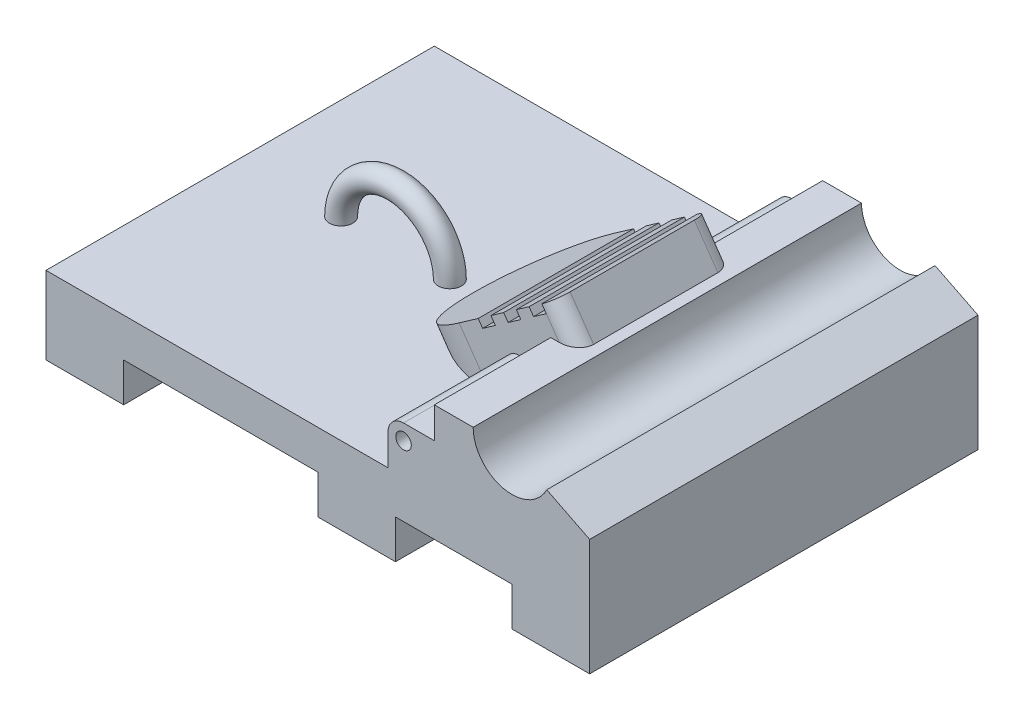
ISO-10303-21;
HEADER;
FILE_DESCRIPTION(('STEP AP214'),'2;1');
FILE_NAME('part.step','',(''),(''),'','','');
FILE_SCHEMA(('AUTOMOTIVE_DESIGN { 1 0 10303 214 1 1 1 1 }'));
ENDSEC;
DATA;
#1=APPLICATION_CONTEXT('core data for automotive mechanical design processes');
#2=APPLICATION_PROTOCOL_DEFINITION('international standard','automotive_design',2000,#1);
#3=PRODUCT_CONTEXT('',#1,'mechanical');
#4=PRODUCT('Part','Part','',(#3));
#5=PRODUCT_RELATED_PRODUCT_CATEGORY('part','',(#4));
#6=PRODUCT_DEFINITION_FORMATION('','',#4);
#7=PRODUCT_DEFINITION_CONTEXT('part definition',#1,'design');
#8=PRODUCT_DEFINITION('design','',#6,#7);
#9=PRODUCT_DEFINITION_SHAPE('','',#8);
#10=(LENGTH_UNIT() NAMED_UNIT(*) SI_UNIT(.MILLI.,.METRE.));
#11=(NAMED_UNIT(*) PLANE_ANGLE_UNIT() SI_UNIT($,.RADIAN.));
#12=(NAMED_UNIT(*) SI_UNIT($,.STERADIAN.) SOLID_ANGLE_UNIT());
#13=UNCERTAINTY_MEASURE_WITH_UNIT(LENGTH_MEASURE(1.E-05),#10,'distance_accuracy_value','');
#14=(GEOMETRIC_REPRESENTATION_CONTEXT(3) GLOBAL_UNCERTAINTY_ASSIGNED_CONTEXT((#13)) GLOBAL_UNIT_ASSIGNED_CONTEXT((#10,
#11,#12)) REPRESENTATION_CONTEXT('',''));
#15=CARTESIAN_POINT('',(0.,0.,0.));
#16=DIRECTION('',(0.,0.,1.));
#17=DIRECTION('',(1.,0.,0.));
#18=AXIS2_PLACEMENT_3D('',#15,#16,#17);
#19=CARTESIAN_POINT('',(76.2,38.1,63.5));
#20=DIRECTION('',(-0.447213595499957,-0.894427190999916,0.));
#21=DIRECTION('',(0.894427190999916,-0.447213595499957,0.));
#22=AXIS2_PLACEMENT_3D('',#19,#20,#21);
#23=PLANE('',#22);
#24=DIRECTION('',(0.,0.,-1.));
#25=VECTOR('',#24,1.);
#26=CARTESIAN_POINT('',(62.1592253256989,45.1203873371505,458.470833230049));
#27=LINE('',#26,#25);
#28=CARTESIAN_POINT('',(62.1592253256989,45.1203873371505,63.5000000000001));
#29=VERTEX_POINT('',#28);
#30=CARTESIAN_POINT('',(62.1592253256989,45.1203873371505,-63.5));
#31=VERTEX_POINT('',#30);
#32=EDGE_CURVE('E67',#29,#31,#27,.T.);
#33=ORIENTED_EDGE('',*,*,#32,.F.);
#34=DIRECTION('',(-0.894427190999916,0.447213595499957,0.));
#35=VECTOR('',#34,1.);
#36=CARTESIAN_POINT('',(76.2,38.1,63.5));
#37=LINE('',#36,#35);
#38=CARTESIAN_POINT('',(76.2,38.1,63.5));
#39=VERTEX_POINT('',#38);
#40=EDGE_CURVE('E332',#39,#29,#37,.T.);
#41=ORIENTED_EDGE('',*,*,#40,.F.);
#42=DIRECTION('',(0.,0.,-1.));
#43=VECTOR('',#42,1.);
#44=CARTESIAN_POINT('',(76.2,38.1,63.5));
#45=LINE('',#44,#43);
#46=CARTESIAN_POINT('',(76.2,38.1,-63.5));
#47=VERTEX_POINT('',#46);
#48=EDGE_CURVE('E437',#39,#47,#45,.T.);
#49=ORIENTED_EDGE('',*,*,#48,.T.);
#50=DIRECTION('',(-0.894427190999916,0.447213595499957,0.));
#51=VECTOR('',#50,1.);
#52=CARTESIAN_POINT('',(76.2,38.1,-63.5));
#53=LINE('',#52,#51);
#54=EDGE_CURVE('E389',#47,#31,#53,.T.);
#55=ORIENTED_EDGE('',*,*,#54,.T.);
#56=EDGE_LOOP('',(#33,#41,#49,#55));
#57=FACE_BOUND('',#56,.T.);
#58=ADVANCED_FACE('F51',(#57),#23,.F.);
#59=CARTESIAN_POINT('',(-4.59353807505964,39.9688414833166,0.));
#60=DIRECTION('',(-0.573576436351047,0.819152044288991,0.));
#61=DIRECTION('',(-0.819152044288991,-0.573576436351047,0.));
#62=AXIS2_PLACEMENT_3D('',#59,#60,#61);
#63=PLANE('',#62);
#64=DIRECTION('',(0.,0.,1.));
#65=VECTOR('',#64,1.);
#66=CARTESIAN_POINT('',(18.2935700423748,55.9945671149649,-25.4));
#67=LINE('',#66,#65);
#68=CARTESIAN_POINT('',(18.2935700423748,55.9945671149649,-25.4));
#69=VERTEX_POINT('',#68);
#70=CARTESIAN_POINT('',(18.2935700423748,55.9945671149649,25.4));
#71=VERTEX_POINT('',#70);
#72=EDGE_CURVE('E588',#69,#71,#67,.T.);
#73=ORIENTED_EDGE('',*,*,#72,.F.);
#74=DIRECTION('',(-0.819152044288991,-0.573576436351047,0.));
#75=VECTOR('',#74,1.);
#76=CARTESIAN_POINT('',(-4.59353807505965,39.9688414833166,-25.4));
#77=LINE('',#76,#75);
#78=CARTESIAN_POINT('',(14.1322776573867,53.0807988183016,-25.3999999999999));
#79=VERTEX_POINT('',#78);
#80=EDGE_CURVE('E680',#69,#79,#77,.T.);
#81=ORIENTED_EDGE('',*,*,#80,.T.);
#82=DIRECTION('',(0.,0.,-1.));
#83=VECTOR('',#82,1.);
#84=CARTESIAN_POINT('',(14.1322776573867,53.0807988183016,-25.3999999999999));
#85=LINE('',#84,#83);
#86=CARTESIAN_POINT('',(14.1322776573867,53.0807988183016,25.4000000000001));
#87=VERTEX_POINT('',#86);
#88=EDGE_CURVE('E620',#87,#79,#85,.T.);
#89=ORIENTED_EDGE('',*,*,#88,.F.);
#90=DIRECTION('',(0.819152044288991,0.573576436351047,0.));
#91=VECTOR('',#90,1.);
#92=CARTESIAN_POINT('',(26.6161548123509,61.8221037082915,25.4));
#93=LINE('',#92,#91);
#94=EDGE_CURVE('E674',#87,#71,#93,.T.);
#95=ORIENTED_EDGE('',*,*,#94,.T.);
#96=EDGE_LOOP('',(#73,#81,#89,#95));
#97=FACE_BOUND('',#96,.T.);
#98=ADVANCED_FACE('F911',(#97),#63,.T.);
#99=DIRECTION('',(0.,0.,-1.));
#100=VECTOR('',#99,1.);
#101=CARTESIAN_POINT('',(22.4548624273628,58.9083354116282,-25.4));
#102=LINE('',#101,#100);
#103=CARTESIAN_POINT('',(22.4548624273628,58.9083354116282,25.4));
#104=VERTEX_POINT('',#103);
#105=CARTESIAN_POINT('',(22.4548624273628,58.9083354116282,-25.4));
#106=VERTEX_POINT('',#105);
#107=EDGE_CURVE('E576',#104,#106,#102,.T.);
#108=ORIENTED_EDGE('',*,*,#107,.F.);
#109=CARTESIAN_POINT('',(22.4548624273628,58.9083354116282,20.32));
#110=DIRECTION('',(-0.573576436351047,0.819152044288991,0.));
#111=DIRECTION('',(-0.819152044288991,-0.573576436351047,0.));
#112=AXIS2_PLACEMENT_3D('',#109,#110,#111);
#113=CIRCLE('',#112,5.08);
#114=CARTESIAN_POINT('',(26.6161548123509,61.8221037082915,20.32));
#115=VERTEX_POINT('',#114);
#116=EDGE_CURVE('E472',#104,#115,#113,.T.);
#117=ORIENTED_EDGE('',*,*,#116,.T.);
#118=DIRECTION('',(0.,0.,-1.));
#119=VECTOR('',#118,1.);
#120=CARTESIAN_POINT('',(26.6161548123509,61.8221037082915,-25.4));
#121=LINE('',#120,#119);
#122=CARTESIAN_POINT('',(26.6161548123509,61.8221037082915,-20.32));
#123=VERTEX_POINT('',#122);
#124=EDGE_CURVE('E679',#115,#123,#121,.T.);
#125=ORIENTED_EDGE('',*,*,#124,.T.);
#126=CARTESIAN_POINT('',(22.4548624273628,58.9083354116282,-20.32));
#127=DIRECTION('',(-0.573576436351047,0.819152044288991,0.));
#128=DIRECTION('',(-0.819152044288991,-0.573576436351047,0.));
#129=AXIS2_PLACEMENT_3D('',#126,#127,#128);
#130=CIRCLE('',#129,5.08);
#131=EDGE_CURVE('E475',#123,#106,#130,.T.);
#132=ORIENTED_EDGE('',*,*,#131,.T.);
#133=EDGE_LOOP('',(#108,#117,#125,#132));
#134=FACE_BOUND('',#133,.T.);
#135=ADVANCED_FACE('F873',(#134),#63,.T.);
#136=DIRECTION('',(0.,0.,1.));
#137=VECTOR('',#136,1.);
#138=CARTESIAN_POINT('',(9.97098527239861,50.1670305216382,-25.3999999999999));
#139=LINE('',#138,#137);
#140=CARTESIAN_POINT('',(9.97098527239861,50.1670305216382,-25.3999999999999));
#141=VERTEX_POINT('',#140);
#142=CARTESIAN_POINT('',(9.97098527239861,50.1670305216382,25.4000000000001));
#143=VERTEX_POINT('',#142);
#144=EDGE_CURVE('E591',#141,#143,#139,.T.);
#145=ORIENTED_EDGE('',*,*,#144,.F.);
#146=CARTESIAN_POINT('',(5.80969288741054,47.2532622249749,-25.3999999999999));
#147=VERTEX_POINT('',#146);
#148=EDGE_CURVE('E678',#141,#147,#77,.T.);
#149=ORIENTED_EDGE('',*,*,#148,.T.);
#150=DIRECTION('',(0.,0.,-1.));
#151=VECTOR('',#150,1.);
#152=CARTESIAN_POINT('',(5.80969288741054,47.2532622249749,-25.3999999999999));
#153=LINE('',#152,#151);
#154=CARTESIAN_POINT('',(5.80969288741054,47.2532622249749,25.4000000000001));
#155=VERTEX_POINT('',#154);
#156=EDGE_CURVE('E652',#155,#147,#153,.T.);
#157=ORIENTED_EDGE('',*,*,#156,.F.);
#158=EDGE_CURVE('E685',#155,#143,#93,.T.);
#159=ORIENTED_EDGE('',*,*,#158,.T.);
#160=EDGE_LOOP('',(#145,#149,#157,#159));
#161=FACE_BOUND('',#160,.T.);
#162=ADVANCED_FACE('F934',(#161),#63,.T.);
#163=CARTESIAN_POINT('',(25.4,50.8,63.5));
#164=DIRECTION('',(1.,0.,0.));
#165=DIRECTION('',(0.,1.,0.));
#166=AXIS2_PLACEMENT_3D('',#163,#164,#165);
#167=PLANE('',#166);
#168=DIRECTION('',(0.,1.,0.));
#169=VECTOR('',#168,1.);
#170=CARTESIAN_POINT('',(25.4,-2.95957555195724,25.4));
#171=LINE('',#170,#169);
#172=CARTESIAN_POINT('',(25.4,40.64,25.4));
#173=VERTEX_POINT('',#172);
#174=CARTESIAN_POINT('',(25.4,50.8,25.4));
#175=VERTEX_POINT('',#174);
#176=EDGE_CURVE('E712',#173,#175,#171,.T.);
#177=ORIENTED_EDGE('',*,*,#176,.F.);
#178=DIRECTION('',(0.,0.,1.));
#179=VECTOR('',#178,1.);
#180=CARTESIAN_POINT('',(25.4,40.64,-84.9921967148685));
#181=LINE('',#180,#179);
#182=CARTESIAN_POINT('',(25.4,40.64,63.5));
#183=VERTEX_POINT('',#182);
#184=EDGE_CURVE('E545',#173,#183,#181,.T.);
#185=ORIENTED_EDGE('',*,*,#184,.T.);
#186=DIRECTION('',(0.,-1.,0.));
#187=VECTOR('',#186,1.);
#188=CARTESIAN_POINT('',(25.4,50.8,63.5));
#189=LINE('',#188,#187);
#190=CARTESIAN_POINT('',(25.4,50.8,63.5));
#191=VERTEX_POINT('',#190);
#192=EDGE_CURVE('E342',#191,#183,#189,.T.);
#193=ORIENTED_EDGE('',*,*,#192,.F.);
#194=DIRECTION('',(0.,0.,-1.));
#195=VECTOR('',#194,1.);
#196=CARTESIAN_POINT('',(25.4,50.8,63.5));
#197=LINE('',#196,#195);
#198=EDGE_CURVE('E339',#191,#175,#197,.T.);
#199=ORIENTED_EDGE('',*,*,#198,.T.);
#200=EDGE_LOOP('',(#177,#185,#193,#199));
#201=FACE_BOUND('',#200,.T.);
#202=ADVANCED_FACE('F779',(#201),#167,.F.);
#203=CARTESIAN_POINT('',(-12.7,12.7,63.5));
#204=DIRECTION('',(1.,0.,0.));
#205=DIRECTION('',(0.,1.,0.));
#206=AXIS2_PLACEMENT_3D('',#203,#204,#205);
#207=PLANE('',#206);
#208=DIRECTION('',(0.,-1.,0.));
#209=VECTOR('',#208,1.);
#210=CARTESIAN_POINT('',(-12.7,12.7,-63.5));
#211=LINE('',#210,#209);
#212=CARTESIAN_POINT('',(-12.7,12.7,-63.5));
#213=VERTEX_POINT('',#212);
#214=CARTESIAN_POINT('',(-12.7,0.,-63.5));
#215=VERTEX_POINT('',#214);
#216=EDGE_CURVE('E366',#213,#215,#211,.T.);
#217=ORIENTED_EDGE('',*,*,#216,.T.);
#218=DIRECTION('',(0.,0.,-1.));
#219=VECTOR('',#218,1.);
#220=CARTESIAN_POINT('',(-12.7,0.,63.5));
#221=LINE('',#220,#219);
#222=CARTESIAN_POINT('',(-12.7,0.,63.5));
#223=VERTEX_POINT('',#222);
#224=EDGE_CURVE('E461',#223,#215,#221,.T.);
#225=ORIENTED_EDGE('',*,*,#224,.F.);
#226=DIRECTION('',(0.,-1.,0.));
#227=VECTOR('',#226,1.);
#228=CARTESIAN_POINT('',(-12.7,12.7,63.5));
#229=LINE('',#228,#227);
#230=CARTESIAN_POINT('',(-12.7,12.7,63.5));
#231=VERTEX_POINT('',#230);
#232=EDGE_CURVE('E414',#231,#223,#229,.T.);
#233=ORIENTED_EDGE('',*,*,#232,.F.);
#234=DIRECTION('',(0.,0.,-1.));
#235=VECTOR('',#234,1.);
#236=CARTESIAN_POINT('',(-12.7,12.7,63.5));
#237=LINE('',#236,#235);
#238=EDGE_CURVE('E365',#231,#213,#237,.T.);
#239=ORIENTED_EDGE('',*,*,#238,.T.);
#240=EDGE_LOOP('',(#217,#225,#233,#239));
#241=FACE_BOUND('',#240,.T.);
#242=ADVANCED_FACE('F828',(#241),#207,.F.);
#243=CARTESIAN_POINT('',(12.7,0.,63.5));
#244=DIRECTION('',(0.,1.,0.));
#245=DIRECTION('',(-1.,0.,0.));
#246=AXIS2_PLACEMENT_3D('',#243,#244,#245);
#247=PLANE('',#246);
#248=DIRECTION('',(1.,0.,0.));
#249=VECTOR('',#248,1.);
#250=CARTESIAN_POINT('',(12.7,0.,-63.5));
#251=LINE('',#250,#249);
#252=CARTESIAN_POINT('',(12.7,0.,-63.5));
#253=VERTEX_POINT('',#252);
#254=EDGE_CURVE('E370',#215,#253,#251,.T.);
#255=ORIENTED_EDGE('',*,*,#254,.T.);
#256=DIRECTION('',(0.,0.,-1.));
#257=VECTOR('',#256,1.);
#258=CARTESIAN_POINT('',(12.7,0.,63.5));
#259=LINE('',#258,#257);
#260=CARTESIAN_POINT('',(12.7,0.,63.5));
#261=VERTEX_POINT('',#260);
#262=EDGE_CURVE('E457',#261,#253,#259,.T.);
#263=ORIENTED_EDGE('',*,*,#262,.F.);
#264=DIRECTION('',(1.,0.,0.));
#265=VECTOR('',#264,1.);
#266=CARTESIAN_POINT('',(12.7,0.,63.5));
#267=LINE('',#266,#265);
#268=EDGE_CURVE('E725',#223,#261,#267,.T.);
#269=ORIENTED_EDGE('',*,*,#268,.F.);
#270=ORIENTED_EDGE('',*,*,#224,.T.);
#271=EDGE_LOOP('',(#255,#263,#269,#270));
#272=FACE_BOUND('',#271,.T.);
#273=ADVANCED_FACE('F833',(#272),#247,.F.);
#274=CARTESIAN_POINT('',(12.7,0.,63.5));
#275=DIRECTION('',(-1.,0.,0.));
#276=DIRECTION('',(0.,-1.,0.));
#277=AXIS2_PLACEMENT_3D('',#274,#275,#276);
#278=PLANE('',#277);
#279=DIRECTION('',(0.,1.,0.));
#280=VECTOR('',#279,1.);
#281=CARTESIAN_POINT('',(12.7,0.,-63.5));
#282=LINE('',#281,#280);
#283=CARTESIAN_POINT('',(12.7,12.7,-63.5));
#284=VERTEX_POINT('',#283);
#285=EDGE_CURVE('E374',#253,#284,#282,.T.);
#286=ORIENTED_EDGE('',*,*,#285,.T.);
#287=DIRECTION('',(0.,0.,-1.));
#288=VECTOR('',#287,1.);
#289=CARTESIAN_POINT('',(12.7,12.7,63.5));
#290=LINE('',#289,#288);
#291=CARTESIAN_POINT('',(12.7,12.7,63.5));
#292=VERTEX_POINT('',#291);
#293=EDGE_CURVE('E453',#292,#284,#290,.T.);
#294=ORIENTED_EDGE('',*,*,#293,.F.);
#295=DIRECTION('',(0.,1.,0.));
#296=VECTOR('',#295,1.);
#297=CARTESIAN_POINT('',(12.7,0.,63.5));
#298=LINE('',#297,#296);
#299=EDGE_CURVE('E728',#261,#292,#298,.T.);
#300=ORIENTED_EDGE('',*,*,#299,.F.);
#301=ORIENTED_EDGE('',*,*,#262,.T.);
#302=EDGE_LOOP('',(#286,#294,#300,#301));
#303=FACE_BOUND('',#302,.T.);
#304=ADVANCED_FACE('F836',(#303),#278,.F.);
#305=CARTESIAN_POINT('',(12.7,12.7,63.5));
#306=DIRECTION('',(0.,1.,0.));
#307=DIRECTION('',(0.,0.,1.));
#308=AXIS2_PLACEMENT_3D('',#305,#306,#307);
#309=PLANE('',#308);
#310=DIRECTION('',(1.,0.,0.));
#311=VECTOR('',#310,1.);
#312=CARTESIAN_POINT('',(12.7,12.7,-63.5));
#313=LINE('',#312,#311);
#314=CARTESIAN_POINT('',(50.8,12.7,-63.5));
#315=VERTEX_POINT('',#314);
#316=EDGE_CURVE('E377',#284,#315,#313,.T.);
#317=ORIENTED_EDGE('',*,*,#316,.T.);
#318=DIRECTION('',(0.,0.,-1.));
#319=VECTOR('',#318,1.);
#320=CARTESIAN_POINT('',(50.8,12.7,63.5));
#321=LINE('',#320,#319);
#322=CARTESIAN_POINT('',(50.8,12.7,63.5));
#323=VERTEX_POINT('',#322);
#324=EDGE_CURVE('E449',#323,#315,#321,.T.);
#325=ORIENTED_EDGE('',*,*,#324,.F.);
#326=DIRECTION('',(1.,0.,0.));
#327=VECTOR('',#326,1.);
#328=CARTESIAN_POINT('',(12.7,12.7,63.5));
#329=LINE('',#328,#327);
#330=EDGE_CURVE('E731',#292,#323,#329,.T.);
#331=ORIENTED_EDGE('',*,*,#330,.F.);
#332=ORIENTED_EDGE('',*,*,#293,.T.);
#333=EDGE_LOOP('',(#317,#325,#331,#332));
#334=FACE_BOUND('',#333,.T.);
#335=ADVANCED_FACE('F841',(#334),#309,.F.);
#336=CARTESIAN_POINT('',(50.8,12.7,63.5));
#337=DIRECTION('',(1.,0.,0.));
#338=DIRECTION('',(0.,0.,-1.));
#339=AXIS2_PLACEMENT_3D('',#336,#337,#338);
#340=PLANE('',#339);
#341=DIRECTION('',(0.,-1.,0.));
#342=VECTOR('',#341,1.);
#343=CARTESIAN_POINT('',(50.8,12.7,-63.5));
#344=LINE('',#343,#342);
#345=CARTESIAN_POINT('',(50.8,0.,-63.5));
#346=VERTEX_POINT('',#345);
#347=EDGE_CURVE('E380',#315,#346,#344,.T.);
#348=ORIENTED_EDGE('',*,*,#347,.T.);
#349=DIRECTION('',(0.,0.,-1.));
#350=VECTOR('',#349,1.);
#351=CARTESIAN_POINT('',(50.8,0.,63.5));
#352=LINE('',#351,#350);
#353=CARTESIAN_POINT('',(50.8,0.,63.5));
#354=VERTEX_POINT('',#353);
#355=EDGE_CURVE('E445',#354,#346,#352,.T.);
#356=ORIENTED_EDGE('',*,*,#355,.F.);
#357=DIRECTION('',(0.,-1.,0.));
#358=VECTOR('',#357,1.);
#359=CARTESIAN_POINT('',(50.8,12.7,63.5));
#360=LINE('',#359,#358);
#361=EDGE_CURVE('E734',#323,#354,#360,.T.);
#362=ORIENTED_EDGE('',*,*,#361,.F.);
#363=ORIENTED_EDGE('',*,*,#324,.T.);
#364=EDGE_LOOP('',(#348,#356,#362,#363));
#365=FACE_BOUND('',#364,.T.);
#366=ADVANCED_FACE('F845',(#365),#340,.F.);
#367=CARTESIAN_POINT('',(50.8,0.,63.5));
#368=DIRECTION('',(0.,1.,0.));
#369=DIRECTION('',(-1.,0.,0.));
#370=AXIS2_PLACEMENT_3D('',#367,#368,#369);
#371=PLANE('',#370);
#372=DIRECTION('',(1.,0.,0.));
#373=VECTOR('',#372,1.);
#374=CARTESIAN_POINT('',(50.8,0.,-63.5));
#375=LINE('',#374,#373);
#376=CARTESIAN_POINT('',(76.2,0.,-63.5));
#377=VERTEX_POINT('',#376);
#378=EDGE_CURVE('E383',#346,#377,#375,.T.);
#379=ORIENTED_EDGE('',*,*,#378,.T.);
#380=DIRECTION('',(0.,0.,-1.));
#381=VECTOR('',#380,1.);
#382=CARTESIAN_POINT('',(76.2,0.,63.5));
#383=LINE('',#382,#381);
#384=CARTESIAN_POINT('',(76.2,0.,63.5));
#385=VERTEX_POINT('',#384);
#386=EDGE_CURVE('E441',#385,#377,#383,.T.);
#387=ORIENTED_EDGE('',*,*,#386,.F.);
#388=DIRECTION('',(1.,0.,0.));
#389=VECTOR('',#388,1.);
#390=CARTESIAN_POINT('',(50.8,0.,63.5));
#391=LINE('',#390,#389);
#392=EDGE_CURVE('E737',#354,#385,#391,.T.);
#393=ORIENTED_EDGE('',*,*,#392,.F.);
#394=ORIENTED_EDGE('',*,*,#355,.T.);
#395=EDGE_LOOP('',(#379,#387,#393,#394));
#396=FACE_BOUND('',#395,.T.);
#397=ADVANCED_FACE('F849',(#396),#371,.F.);
#398=CARTESIAN_POINT('',(76.2,0.,63.5));
#399=DIRECTION('',(-1.,0.,0.));
#400=DIRECTION('',(0.,-1.,0.));
#401=AXIS2_PLACEMENT_3D('',#398,#399,#400);
#402=PLANE('',#401);
#403=DIRECTION('',(0.,1.,0.));
#404=VECTOR('',#403,1.);
#405=CARTESIAN_POINT('',(76.2,0.,-63.5));
#406=LINE('',#405,#404);
#407=EDGE_CURVE('E386',#377,#47,#406,.T.);
#408=ORIENTED_EDGE('',*,*,#407,.T.);
#409=ORIENTED_EDGE('',*,*,#48,.F.);
#410=DIRECTION('',(0.,1.,0.));
#411=VECTOR('',#410,1.);
#412=CARTESIAN_POINT('',(76.2,0.,63.5));
#413=LINE('',#412,#411);
#414=EDGE_CURVE('E347',#385,#39,#413,.T.);
#415=ORIENTED_EDGE('',*,*,#414,.F.);
#416=ORIENTED_EDGE('',*,*,#386,.T.);
#417=EDGE_LOOP('',(#408,#409,#415,#416));
#418=FACE_BOUND('',#417,.T.);
#419=ADVANCED_FACE('F745',(#418),#402,.F.);
#420=CARTESIAN_POINT('',(50.8,50.8,63.5));
#421=DIRECTION('',(0.,-1.,0.));
#422=DIRECTION('',(1.,0.,0.));
#423=AXIS2_PLACEMENT_3D('',#420,#421,#422);
#424=PLANE('',#423);
#425=DIRECTION('',(-1.,0.,0.));
#426=VECTOR('',#425,1.);
#427=CARTESIAN_POINT('',(50.8,50.8,63.5));
#428=LINE('',#427,#426);
#429=CARTESIAN_POINT('',(38.1,50.8,63.5000000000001));
#430=VERTEX_POINT('',#429);
#431=EDGE_CURVE('E329',#430,#191,#428,.T.);
#432=ORIENTED_EDGE('',*,*,#431,.F.);
#433=DIRECTION('',(0.,0.,-1.));
#434=VECTOR('',#433,1.);
#435=CARTESIAN_POINT('',(38.1,50.8,458.470833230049));
#436=LINE('',#435,#434);
#437=CARTESIAN_POINT('',(38.1,50.8,-63.4999999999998));
#438=VERTEX_POINT('',#437);
#439=EDGE_CURVE('E315',#430,#438,#436,.T.);
#440=ORIENTED_EDGE('',*,*,#439,.T.);
#441=DIRECTION('',(-1.,0.,0.));
#442=VECTOR('',#441,1.);
#443=CARTESIAN_POINT('',(50.8,50.8,-63.5));
#444=LINE('',#443,#442);
#445=CARTESIAN_POINT('',(25.4,50.8,-63.5));
#446=VERTEX_POINT('',#445);
#447=EDGE_CURVE('E393',#438,#446,#444,.T.);
#448=ORIENTED_EDGE('',*,*,#447,.T.);
#449=CARTESIAN_POINT('',(25.4,50.8,-25.4));
#450=VERTEX_POINT('',#449);
#451=EDGE_CURVE('E434',#450,#446,#197,.T.);
#452=ORIENTED_EDGE('',*,*,#451,.F.);
#453=DIRECTION('',(-1.,0.,0.));
#454=VECTOR('',#453,1.);
#455=CARTESIAN_POINT('',(40.7670820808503,50.8,-25.4));
#456=LINE('',#455,#454);
#457=CARTESIAN_POINT('',(28.1323800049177,50.8,-25.4));
#458=VERTEX_POINT('',#457);
#459=EDGE_CURVE('E692',#458,#450,#456,.T.);
#460=ORIENTED_EDGE('',*,*,#459,.F.);
#461=CARTESIAN_POINT('',(28.1323800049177,50.8,-20.32));
#462=DIRECTION('',(0.,-1.,0.));
#463=DIRECTION('',(-1.,0.,0.));
#464=AXIS2_PLACEMENT_3D('',#461,#462,#463);
#465=ELLIPSE('',#464,6.2015349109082,5.08);
#466=CARTESIAN_POINT('',(34.3339149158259,50.8,-20.32));
#467=VERTEX_POINT('',#466);
#468=EDGE_CURVE('E487',#458,#467,#465,.T.);
#469=ORIENTED_EDGE('',*,*,#468,.T.);
#470=DIRECTION('',(0.,0.,-1.));
#471=VECTOR('',#470,1.);
#472=CARTESIAN_POINT('',(34.3339149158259,50.8,-25.4));
#473=LINE('',#472,#471);
#474=CARTESIAN_POINT('',(34.3339149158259,50.8,20.32));
#475=VERTEX_POINT('',#474);
#476=EDGE_CURVE('E704',#475,#467,#473,.T.);
#477=ORIENTED_EDGE('',*,*,#476,.F.);
#478=CARTESIAN_POINT('',(28.1323800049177,50.8,20.32));
#479=DIRECTION('',(0.,-1.,0.));
#480=DIRECTION('',(-1.,0.,0.));
#481=AXIS2_PLACEMENT_3D('',#478,#479,#480);
#482=ELLIPSE('',#481,6.2015349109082,5.08);
#483=CARTESIAN_POINT('',(28.1323800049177,50.8,25.4));
#484=VERTEX_POINT('',#483);
#485=EDGE_CURVE('E490',#475,#484,#482,.T.);
#486=ORIENTED_EDGE('',*,*,#485,.T.);
#487=DIRECTION('',(1.,0.,0.));
#488=VECTOR('',#487,1.);
#489=CARTESIAN_POINT('',(71.9767749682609,50.8,25.4));
#490=LINE('',#489,#488);
#491=EDGE_CURVE('E716',#175,#484,#490,.T.);
#492=ORIENTED_EDGE('',*,*,#491,.F.);
#493=ORIENTED_EDGE('',*,*,#198,.F.);
#494=EDGE_LOOP('',(#432,#440,#448,#452,#460,#469,#477,#486,#492,#493));
#495=FACE_BOUND('',#494,.T.);
#496=ADVANCED_FACE('F336',(#495),#424,.F.);
#497=DIRECTION('',(0.,-1.,0.));
#498=VECTOR('',#497,1.);
#499=CARTESIAN_POINT('',(25.4,50.8,-63.5));
#500=LINE('',#499,#498);
#501=CARTESIAN_POINT('',(25.4,40.64,-63.5));
#502=VERTEX_POINT('',#501);
#503=EDGE_CURVE('E396',#446,#502,#500,.T.);
#504=ORIENTED_EDGE('',*,*,#503,.T.);
#505=CARTESIAN_POINT('',(25.4,40.64,-25.4));
#506=VERTEX_POINT('',#505);
#507=EDGE_CURVE('E513',#502,#506,#181,.T.);
#508=ORIENTED_EDGE('',*,*,#507,.T.);
#509=DIRECTION('',(0.,-1.,0.));
#510=VECTOR('',#509,1.);
#511=CARTESIAN_POINT('',(25.4,-24.8128377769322,-25.4));
#512=LINE('',#511,#510);
#513=EDGE_CURVE('E520',#450,#506,#512,.T.);
#514=ORIENTED_EDGE('',*,*,#513,.F.);
#515=ORIENTED_EDGE('',*,*,#451,.T.);
#516=EDGE_LOOP('',(#504,#508,#514,#515));
#517=FACE_BOUND('',#516,.T.);
#518=ADVANCED_FACE('F855',(#517),#167,.F.);
#519=CARTESIAN_POINT('',(25.4,25.4,63.5));
#520=DIRECTION('',(0.,-1.,0.));
#521=DIRECTION('',(1.,0.,0.));
#522=AXIS2_PLACEMENT_3D('',#519,#520,#521);
#523=PLANE('',#522);
#524=CARTESIAN_POINT('',(-68.58,25.4,0.));
#525=DIRECTION('',(0.,1.,0.));
#526=DIRECTION('',(0.,0.,1.));
#527=AXIS2_PLACEMENT_3D('',#524,#525,#526);
#528=CIRCLE('',#527,3.80999999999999);
#529=CARTESIAN_POINT('',(-72.39,25.4,0.));
#530=VERTEX_POINT('',#529);
#531=EDGE_CURVE('E562',#530,#530,#528,.T.);
#532=ORIENTED_EDGE('',*,*,#531,.F.);
#533=EDGE_LOOP('',(#532));
#534=FACE_BOUND('',#533,.T.);
#535=CARTESIAN_POINT('',(-33.02,25.4,0.));
#536=DIRECTION('',(0.,-1.,0.));
#537=DIRECTION('',(0.,0.,1.));
#538=AXIS2_PLACEMENT_3D('',#535,#536,#537);
#539=CIRCLE('',#538,3.80999999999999);
#540=CARTESIAN_POINT('',(-29.21,25.4,0.));
#541=VERTEX_POINT('',#540);
#542=EDGE_CURVE('E566',#541,#541,#539,.T.);
#543=ORIENTED_EDGE('',*,*,#542,.T.);
#544=EDGE_LOOP('',(#543));
#545=FACE_BOUND('',#544,.T.);
#546=DIRECTION('',(-1.,0.,0.));
#547=VECTOR('',#546,1.);
#548=CARTESIAN_POINT('',(25.4,25.4,63.5));
#549=LINE('',#548,#547);
#550=CARTESIAN_POINT('',(10.2455643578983,25.4,63.5));
#551=VERTEX_POINT('',#550);
#552=CARTESIAN_POINT('',(-101.6,25.4,63.5));
#553=VERTEX_POINT('',#552);
#554=EDGE_CURVE('E74',#551,#553,#549,.T.);
#555=ORIENTED_EDGE('',*,*,#554,.F.);
#556=DIRECTION('',(0.,0.,1.));
#557=VECTOR('',#556,1.);
#558=CARTESIAN_POINT('',(10.2455643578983,25.4,-84.9921967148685));
#559=LINE('',#558,#557);
#560=CARTESIAN_POINT('',(10.2455643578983,25.4,25.4));
#561=VERTEX_POINT('',#560);
#562=EDGE_CURVE('E772',#561,#551,#559,.T.);
#563=ORIENTED_EDGE('',*,*,#562,.F.);
#564=DIRECTION('',(1.,0.,0.));
#565=VECTOR('',#564,1.);
#566=CARTESIAN_POINT('',(71.9767749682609,25.4,25.4));
#567=LINE('',#566,#565);
#568=CARTESIAN_POINT('',(5.607674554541,25.4,25.4));
#569=VERTEX_POINT('',#568);
#570=EDGE_CURVE('E708',#569,#561,#567,.T.);
#571=ORIENTED_EDGE('',*,*,#570,.F.);
#572=CARTESIAN_POINT('',(5.60767455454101,25.4,0.));
#573=DIRECTION('',(0.,-1.,0.));
#574=DIRECTION('',(-1.,0.,0.));
#575=AXIS2_PLACEMENT_3D('',#572,#573,#574);
#576=ELLIPSE('',#575,31.007674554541,25.4);
#577=CARTESIAN_POINT('',(-25.4,25.4,0.));
#578=VERTEX_POINT('',#577);
#579=EDGE_CURVE('E371',#578,#569,#576,.F.);
#580=ORIENTED_EDGE('',*,*,#579,.F.);
#581=CARTESIAN_POINT('',(5.607674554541,25.4,-25.4));
#582=VERTEX_POINT('',#581);
#583=EDGE_CURVE('E707',#582,#578,#576,.F.);
#584=ORIENTED_EDGE('',*,*,#583,.F.);
#585=DIRECTION('',(-1.,0.,0.));
#586=VECTOR('',#585,1.);
#587=CARTESIAN_POINT('',(40.7670820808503,25.4,-25.4));
#588=LINE('',#587,#586);
#589=CARTESIAN_POINT('',(10.2455643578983,25.4,-25.4));
#590=VERTEX_POINT('',#589);
#591=EDGE_CURVE('E701',#590,#582,#588,.T.);
#592=ORIENTED_EDGE('',*,*,#591,.F.);
#593=CARTESIAN_POINT('',(10.2455643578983,25.4,-63.5));
#594=VERTEX_POINT('',#593);
#595=EDGE_CURVE('E541',#594,#590,#559,.T.);
#596=ORIENTED_EDGE('',*,*,#595,.F.);
#597=DIRECTION('',(-1.,0.,0.));
#598=VECTOR('',#597,1.);
#599=CARTESIAN_POINT('',(25.4,25.4,-63.5));
#600=LINE('',#599,#598);
#601=CARTESIAN_POINT('',(-101.6,25.4,-63.5));
#602=VERTEX_POINT('',#601);
#603=EDGE_CURVE('E399',#594,#602,#600,.T.);
#604=ORIENTED_EDGE('',*,*,#603,.T.);
#605=DIRECTION('',(0.,0.,-1.));
#606=VECTOR('',#605,1.);
#607=CARTESIAN_POINT('',(-101.6,25.4,63.5));
#608=LINE('',#607,#606);
#609=EDGE_CURVE('E430',#553,#602,#608,.T.);
#610=ORIENTED_EDGE('',*,*,#609,.F.);
#611=EDGE_LOOP('',(#555,#563,#571,#580,#584,#592,#596,#604,#610));
#612=FACE_BOUND('',#611,.T.);
#613=ADVANCED_FACE('F799',(#534,#545,#612),#523,.F.);
#614=CARTESIAN_POINT('',(-101.6,25.4,63.5));
#615=DIRECTION('',(1.,0.,0.));
#616=DIRECTION('',(0.,1.,0.));
#617=AXIS2_PLACEMENT_3D('',#614,#615,#616);
#618=PLANE('',#617);
#619=DIRECTION('',(0.,-1.,0.));
#620=VECTOR('',#619,1.);
#621=CARTESIAN_POINT('',(-101.6,25.4,-63.5));
#622=LINE('',#621,#620);
#623=CARTESIAN_POINT('',(-101.6,0.,-63.5));
#624=VERTEX_POINT('',#623);
#625=EDGE_CURVE('E402',#602,#624,#622,.T.);
#626=ORIENTED_EDGE('',*,*,#625,.T.);
#627=DIRECTION('',(0.,0.,-1.));
#628=VECTOR('',#627,1.);
#629=CARTESIAN_POINT('',(-101.6,0.,63.5));
#630=LINE('',#629,#628);
#631=CARTESIAN_POINT('',(-101.6,0.,63.5));
#632=VERTEX_POINT('',#631);
#633=EDGE_CURVE('E426',#632,#624,#630,.T.);
#634=ORIENTED_EDGE('',*,*,#633,.F.);
#635=DIRECTION('',(0.,-1.,0.));
#636=VECTOR('',#635,1.);
#637=CARTESIAN_POINT('',(-101.6,25.4,63.5));
#638=LINE('',#637,#636);
#639=EDGE_CURVE('E353',#553,#632,#638,.T.);
#640=ORIENTED_EDGE('',*,*,#639,.F.);
#641=ORIENTED_EDGE('',*,*,#609,.T.);
#642=EDGE_LOOP('',(#626,#634,#640,#641));
#643=FACE_BOUND('',#642,.T.);
#644=ADVANCED_FACE('F809',(#643),#618,.F.);
#645=CARTESIAN_POINT('',(-101.6,0.,63.5));
#646=DIRECTION('',(0.,1.,0.));
#647=DIRECTION('',(-1.,0.,0.));
#648=AXIS2_PLACEMENT_3D('',#645,#646,#647);
#649=PLANE('',#648);
#650=DIRECTION('',(1.,0.,0.));
#651=VECTOR('',#650,1.);
#652=CARTESIAN_POINT('',(-101.6,0.,-63.5));
#653=LINE('',#652,#651);
#654=CARTESIAN_POINT('',(-76.2,0.,-63.5));
#655=VERTEX_POINT('',#654);
#656=EDGE_CURVE('E405',#624,#655,#653,.T.);
#657=ORIENTED_EDGE('',*,*,#656,.T.);
#658=DIRECTION('',(0.,0.,-1.));
#659=VECTOR('',#658,1.);
#660=CARTESIAN_POINT('',(-76.2,0.,63.5));
#661=LINE('',#660,#659);
#662=CARTESIAN_POINT('',(-76.2,0.,63.5));
#663=VERTEX_POINT('',#662);
#664=EDGE_CURVE('E422',#663,#655,#661,.T.);
#665=ORIENTED_EDGE('',*,*,#664,.F.);
#666=DIRECTION('',(1.,0.,0.));
#667=VECTOR('',#666,1.);
#668=CARTESIAN_POINT('',(-101.6,0.,63.5));
#669=LINE('',#668,#667);
#670=EDGE_CURVE('E356',#632,#663,#669,.T.);
#671=ORIENTED_EDGE('',*,*,#670,.F.);
#672=ORIENTED_EDGE('',*,*,#633,.T.);
#673=EDGE_LOOP('',(#657,#665,#671,#672));
#674=FACE_BOUND('',#673,.T.);
#675=ADVANCED_FACE('F813',(#674),#649,.F.);
#676=CARTESIAN_POINT('',(-76.2,0.,63.5));
#677=DIRECTION('',(-1.,0.,0.));
#678=DIRECTION('',(0.,-1.,0.));
#679=AXIS2_PLACEMENT_3D('',#676,#677,#678);
#680=PLANE('',#679);
#681=DIRECTION('',(0.,1.,0.));
#682=VECTOR('',#681,1.);
#683=CARTESIAN_POINT('',(-76.2,0.,-63.5));
#684=LINE('',#683,#682);
#685=CARTESIAN_POINT('',(-76.2,12.6999999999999,-63.5));
#686=VERTEX_POINT('',#685);
#687=EDGE_CURVE('E408',#655,#686,#684,.T.);
#688=ORIENTED_EDGE('',*,*,#687,.T.);
#689=DIRECTION('',(0.,0.,-1.));
#690=VECTOR('',#689,1.);
#691=CARTESIAN_POINT('',(-76.2,12.6999999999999,63.5));
#692=LINE('',#691,#690);
#693=CARTESIAN_POINT('',(-76.2,12.6999999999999,63.5));
#694=VERTEX_POINT('',#693);
#695=EDGE_CURVE('E418',#694,#686,#692,.T.);
#696=ORIENTED_EDGE('',*,*,#695,.F.);
#697=DIRECTION('',(0.,1.,0.));
#698=VECTOR('',#697,1.);
#699=CARTESIAN_POINT('',(-76.2,0.,63.5));
#700=LINE('',#699,#698);
#701=EDGE_CURVE('E359',#663,#694,#700,.T.);
#702=ORIENTED_EDGE('',*,*,#701,.F.);
#703=ORIENTED_EDGE('',*,*,#664,.T.);
#704=EDGE_LOOP('',(#688,#696,#702,#703));
#705=FACE_BOUND('',#704,.T.);
#706=ADVANCED_FACE('F820',(#705),#680,.F.);
#707=CARTESIAN_POINT('',(-76.2,12.6999999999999,63.5));
#708=DIRECTION('',(0.,1.,0.));
#709=DIRECTION('',(-1.,0.,0.));
#710=AXIS2_PLACEMENT_3D('',#707,#708,#709);
#711=PLANE('',#710);
#712=DIRECTION('',(1.,0.,0.));
#713=VECTOR('',#712,1.);
#714=CARTESIAN_POINT('',(-76.2,12.6999999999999,-63.5));
#715=LINE('',#714,#713);
#716=EDGE_CURVE('E411',#686,#213,#715,.T.);
#717=ORIENTED_EDGE('',*,*,#716,.T.);
#718=ORIENTED_EDGE('',*,*,#238,.F.);
#719=DIRECTION('',(1.,0.,0.));
#720=VECTOR('',#719,1.);
#721=CARTESIAN_POINT('',(-76.2,12.6999999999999,63.5));
#722=LINE('',#721,#720);
#723=EDGE_CURVE('E362',#694,#231,#722,.T.);
#724=ORIENTED_EDGE('',*,*,#723,.F.);
#725=ORIENTED_EDGE('',*,*,#695,.T.);
#726=EDGE_LOOP('',(#717,#718,#724,#725));
#727=FACE_BOUND('',#726,.T.);
#728=ADVANCED_FACE('F823',(#727),#711,.F.);
#729=CARTESIAN_POINT('',(0.,0.,63.5));
#730=DIRECTION('',(0.,0.,-1.));
#731=DIRECTION('',(-1.,0.,0.));
#732=AXIS2_PLACEMENT_3D('',#729,#730,#731);
#733=PLANE('',#732);
#734=CARTESIAN_POINT('',(50.8,50.8,63.5));
#735=DIRECTION('',(0.,0.,-1.));
#736=DIRECTION('',(-1.,0.,0.));
#737=AXIS2_PLACEMENT_3D('',#734,#735,#736);
#738=CIRCLE('',#737,12.7);
#739=EDGE_CURVE('E318',#430,#29,#738,.F.);
#740=ORIENTED_EDGE('',*,*,#739,.F.);
#741=ORIENTED_EDGE('',*,*,#431,.T.);
#742=ORIENTED_EDGE('',*,*,#192,.T.);
#743=DIRECTION('',(-1.,0.,0.));
#744=VECTOR('',#743,1.);
#745=CARTESIAN_POINT('',(25.4,40.64,63.5));
#746=LINE('',#745,#744);
#747=CARTESIAN_POINT('',(15.3255643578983,40.64,63.5));
#748=VERTEX_POINT('',#747);
#749=EDGE_CURVE('E537',#183,#748,#746,.T.);
#750=ORIENTED_EDGE('',*,*,#749,.T.);
#751=CARTESIAN_POINT('',(15.3255643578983,35.56,63.5));
#752=DIRECTION('',(0.,0.,1.));
#753=DIRECTION('',(1.,0.,0.));
#754=AXIS2_PLACEMENT_3D('',#751,#752,#753);
#755=CIRCLE('',#754,5.08);
#756=CARTESIAN_POINT('',(10.2455643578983,35.56,63.5));
#757=VERTEX_POINT('',#756);
#758=EDGE_CURVE('E756',#748,#757,#755,.T.);
#759=ORIENTED_EDGE('',*,*,#758,.T.);
#760=DIRECTION('',(0.,-1.,0.));
#761=VECTOR('',#760,1.);
#762=CARTESIAN_POINT('',(10.2455643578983,25.4,63.5));
#763=LINE('',#762,#761);
#764=EDGE_CURVE('E752',#757,#551,#763,.T.);
#765=ORIENTED_EDGE('',*,*,#764,.T.);
#766=ORIENTED_EDGE('',*,*,#554,.T.);
#767=ORIENTED_EDGE('',*,*,#639,.T.);
#768=ORIENTED_EDGE('',*,*,#670,.T.);
#769=ORIENTED_EDGE('',*,*,#701,.T.);
#770=ORIENTED_EDGE('',*,*,#723,.T.);
#771=ORIENTED_EDGE('',*,*,#232,.T.);
#772=ORIENTED_EDGE('',*,*,#268,.T.);
#773=ORIENTED_EDGE('',*,*,#299,.T.);
#774=ORIENTED_EDGE('',*,*,#330,.T.);
#775=ORIENTED_EDGE('',*,*,#361,.T.);
#776=ORIENTED_EDGE('',*,*,#392,.T.);
#777=ORIENTED_EDGE('',*,*,#414,.T.);
#778=ORIENTED_EDGE('',*,*,#40,.T.);
#779=EDGE_LOOP('',(#740,#741,#742,#750,#759,#765,#766,#767,#768,#769,#770,#771,#772,#773,#774,
#775,#776,#777,#778));
#780=FACE_BOUND('',#779,.T.);
#781=CARTESIAN_POINT('',(15.3255643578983,35.56,63.5));
#782=DIRECTION('',(0.,0.,1.));
#783=DIRECTION('',(1.,0.,0.));
#784=AXIS2_PLACEMENT_3D('',#781,#782,#783);
#785=CIRCLE('',#784,2.54);
#786=CARTESIAN_POINT('',(17.8655643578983,35.56,63.5));
#787=VERTEX_POINT('',#786);
#788=EDGE_CURVE('E531',#787,#787,#785,.T.);
#789=ORIENTED_EDGE('',*,*,#788,.F.);
#790=EDGE_LOOP('',(#789));
#791=FACE_BOUND('',#790,.T.);
#792=ADVANCED_FACE('F326',(#780,#791),#733,.F.);
#793=CARTESIAN_POINT('',(0.,0.,-63.5));
#794=DIRECTION('',(0.,0.,-1.));
#795=DIRECTION('',(-1.,0.,0.));
#796=AXIS2_PLACEMENT_3D('',#793,#794,#795);
#797=PLANE('',#796);
#798=ORIENTED_EDGE('',*,*,#447,.F.);
#799=CARTESIAN_POINT('',(50.8,50.8,-63.5));
#800=DIRECTION('',(0.,0.,-1.));
#801=DIRECTION('',(-1.,0.,0.));
#802=AXIS2_PLACEMENT_3D('',#799,#800,#801);
#803=CIRCLE('',#802,12.7);
#804=EDGE_CURVE('E12',#438,#31,#803,.F.);
#805=ORIENTED_EDGE('',*,*,#804,.T.);
#806=ORIENTED_EDGE('',*,*,#54,.F.);
#807=ORIENTED_EDGE('',*,*,#407,.F.);
#808=ORIENTED_EDGE('',*,*,#378,.F.);
#809=ORIENTED_EDGE('',*,*,#347,.F.);
#810=ORIENTED_EDGE('',*,*,#316,.F.);
#811=ORIENTED_EDGE('',*,*,#285,.F.);
#812=ORIENTED_EDGE('',*,*,#254,.F.);
#813=ORIENTED_EDGE('',*,*,#216,.F.);
#814=ORIENTED_EDGE('',*,*,#716,.F.);
#815=ORIENTED_EDGE('',*,*,#687,.F.);
#816=ORIENTED_EDGE('',*,*,#656,.F.);
#817=ORIENTED_EDGE('',*,*,#625,.F.);
#818=ORIENTED_EDGE('',*,*,#603,.F.);
#819=DIRECTION('',(0.,-1.,0.));
#820=VECTOR('',#819,1.);
#821=CARTESIAN_POINT('',(10.2455643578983,25.4,-63.5));
#822=LINE('',#821,#820);
#823=CARTESIAN_POINT('',(10.2455643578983,35.56,-63.5));
#824=VERTEX_POINT('',#823);
#825=EDGE_CURVE('E770',#824,#594,#822,.T.);
#826=ORIENTED_EDGE('',*,*,#825,.F.);
#827=CARTESIAN_POINT('',(15.3255643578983,35.56,-63.5));
#828=DIRECTION('',(0.,0.,-1.));
#829=DIRECTION('',(-1.,0.,0.));
#830=AXIS2_PLACEMENT_3D('',#827,#828,#829);
#831=CIRCLE('',#830,5.08);
#832=CARTESIAN_POINT('',(15.3255643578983,40.64,-63.5));
#833=VERTEX_POINT('',#832);
#834=EDGE_CURVE('E527',#833,#824,#831,.F.);
#835=ORIENTED_EDGE('',*,*,#834,.F.);
#836=DIRECTION('',(-1.,0.,0.));
#837=VECTOR('',#836,1.);
#838=CARTESIAN_POINT('',(25.4,40.64,-63.5));
#839=LINE('',#838,#837);
#840=EDGE_CURVE('E334',#502,#833,#839,.T.);
#841=ORIENTED_EDGE('',*,*,#840,.F.);
#842=ORIENTED_EDGE('',*,*,#503,.F.);
#843=EDGE_LOOP('',(#798,#805,#806,#807,#808,#809,#810,#811,#812,#813,#814,#815,#816,#817,#818,
#826,#835,#841,#842));
#844=FACE_BOUND('',#843,.T.);
#845=CARTESIAN_POINT('',(15.3255643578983,35.56,-63.5));
#846=DIRECTION('',(0.,0.,-1.));
#847=DIRECTION('',(-1.,0.,0.));
#848=AXIS2_PLACEMENT_3D('',#845,#846,#847);
#849=CIRCLE('',#848,2.54);
#850=CARTESIAN_POINT('',(12.7855643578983,35.56,-63.5));
#851=VERTEX_POINT('',#850);
#852=EDGE_CURVE('E499',#851,#851,#849,.F.);
#853=ORIENTED_EDGE('',*,*,#852,.T.);
#854=EDGE_LOOP('',(#853));
#855=FACE_BOUND('',#854,.T.);
#856=ADVANCED_FACE('F803',(#844,#855),#797,.T.);
#857=CARTESIAN_POINT('',(40.7670820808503,-24.8128377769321,0.));
#858=DIRECTION('',(-0.573576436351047,0.819152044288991,0.));
#859=DIRECTION('',(-0.819152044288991,-0.573576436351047,0.));
#860=AXIS2_PLACEMENT_3D('',#857,#858,#859);
#861=CYLINDRICAL_SURFACE('',#860,25.4);
#862=CARTESIAN_POINT('',(-4.59353807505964,39.9688414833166,0.));
#863=DIRECTION('',(-0.573576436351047,0.819152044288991,0.));
#864=DIRECTION('',(-0.819152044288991,-0.573576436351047,0.));
#865=AXIS2_PLACEMENT_3D('',#862,#863,#864);
#866=CIRCLE('',#865,25.4);
#867=CARTESIAN_POINT('',(-4.59353807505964,39.9688414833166,25.4));
#868=VERTEX_POINT('',#867);
#869=EDGE_CURVE('E597',#578,#868,#866,.T.);
#870=ORIENTED_EDGE('',*,*,#869,.F.);
#871=ORIENTED_EDGE('',*,*,#579,.T.);
#872=DIRECTION('',(-0.573576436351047,0.819152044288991,0.));
#873=VECTOR('',#872,1.);
#874=CARTESIAN_POINT('',(40.7670820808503,-24.8128377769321,25.4));
#875=LINE('',#874,#873);
#876=EDGE_CURVE('E689',#569,#868,#875,.T.);
#877=ORIENTED_EDGE('',*,*,#876,.T.);
#878=EDGE_LOOP('',(#870,#871,#877));
#879=FACE_BOUND('',#878,.T.);
#880=ADVANCED_FACE('F887',(#879),#861,.T.);
#881=CARTESIAN_POINT('',(71.9767749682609,-2.95957555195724,25.4));
#882=DIRECTION('',(0.,0.,1.));
#883=DIRECTION('',(0.,-1.,0.));
#884=AXIS2_PLACEMENT_3D('',#881,#882,#883);
#885=PLANE('',#884);
#886=DIRECTION('',(-1.,0.,0.));
#887=VECTOR('',#886,1.);
#888=CARTESIAN_POINT('',(71.9767749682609,40.64,25.4));
#889=LINE('',#888,#887);
#890=CARTESIAN_POINT('',(15.3255643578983,40.64,25.4));
#891=VERTEX_POINT('',#890);
#892=EDGE_CURVE('E558',#173,#891,#889,.T.);
#893=ORIENTED_EDGE('',*,*,#892,.F.);
#894=ORIENTED_EDGE('',*,*,#176,.T.);
#895=ORIENTED_EDGE('',*,*,#491,.T.);
#896=DIRECTION('',(-0.573576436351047,0.819152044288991,0.));
#897=VECTOR('',#896,1.);
#898=CARTESIAN_POINT('',(67.8154825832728,-5.87334384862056,25.4));
#899=LINE('',#898,#897);
#900=CARTESIAN_POINT('',(23.9117465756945,56.8276892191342,25.4));
#901=VERTEX_POINT('',#900);
#902=EDGE_CURVE('E483',#484,#901,#899,.T.);
#903=ORIENTED_EDGE('',*,*,#902,.T.);
#904=DIRECTION('',(0.819152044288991,0.573576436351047,0.));
#905=VECTOR('',#904,1.);
#906=CARTESIAN_POINT('',(19.7504541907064,53.9139209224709,25.4));
#907=LINE('',#906,#905);
#908=CARTESIAN_POINT('',(19.7504541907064,53.9139209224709,25.4));
#909=VERTEX_POINT('',#908);
#910=EDGE_CURVE('E575',#909,#901,#907,.T.);
#911=ORIENTED_EDGE('',*,*,#910,.F.);
#912=DIRECTION('',(-0.573576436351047,0.819152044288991,0.));
#913=VECTOR('',#912,1.);
#914=CARTESIAN_POINT('',(19.7504541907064,53.9139209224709,25.4));
#915=LINE('',#914,#913);
#916=EDGE_CURVE('E587',#909,#71,#915,.T.);
#917=ORIENTED_EDGE('',*,*,#916,.T.);
#918=ORIENTED_EDGE('',*,*,#94,.F.);
#919=DIRECTION('',(-0.573576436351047,0.819152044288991,0.));
#920=VECTOR('',#919,1.);
#921=CARTESIAN_POINT('',(15.5891618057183,51.0001526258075,25.4000000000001));
#922=LINE('',#921,#920);
#923=CARTESIAN_POINT('',(15.5891618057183,51.0001526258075,25.4000000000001));
#924=VERTEX_POINT('',#923);
#925=EDGE_CURVE('E612',#924,#87,#922,.T.);
#926=ORIENTED_EDGE('',*,*,#925,.F.);
#927=DIRECTION('',(0.819152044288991,0.573576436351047,0.));
#928=VECTOR('',#927,1.);
#929=CARTESIAN_POINT('',(11.4278694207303,48.0863843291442,25.4000000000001));
#930=LINE('',#929,#928);
#931=CARTESIAN_POINT('',(11.4278694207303,48.0863843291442,25.4000000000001));
#932=VERTEX_POINT('',#931);
#933=EDGE_CURVE('E628',#932,#924,#930,.T.);
#934=ORIENTED_EDGE('',*,*,#933,.F.);
#935=DIRECTION('',(-0.573576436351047,0.819152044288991,0.));
#936=VECTOR('',#935,1.);
#937=CARTESIAN_POINT('',(11.4278694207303,48.0863843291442,25.4000000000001));
#938=LINE('',#937,#936);
#939=EDGE_CURVE('E608',#932,#143,#938,.T.);
#940=ORIENTED_EDGE('',*,*,#939,.T.);
#941=ORIENTED_EDGE('',*,*,#158,.F.);
#942=DIRECTION('',(-0.573576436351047,0.819152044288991,0.));
#943=VECTOR('',#942,1.);
#944=CARTESIAN_POINT('',(7.2665770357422,45.1726160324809,25.4000000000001));
#945=LINE('',#944,#943);
#946=CARTESIAN_POINT('',(7.2665770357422,45.1726160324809,25.4000000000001));
#947=VERTEX_POINT('',#946);
#948=EDGE_CURVE('E646',#947,#155,#945,.T.);
#949=ORIENTED_EDGE('',*,*,#948,.F.);
#950=DIRECTION('',(0.81915204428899,0.573576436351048,0.));
#951=VECTOR('',#950,1.);
#952=CARTESIAN_POINT('',(3.10528465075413,42.2588477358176,25.4000000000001));
#953=LINE('',#952,#951);
#954=CARTESIAN_POINT('',(3.10528465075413,42.2588477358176,25.4000000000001));
#955=VERTEX_POINT('',#954);
#956=EDGE_CURVE('E660',#955,#947,#953,.T.);
#957=ORIENTED_EDGE('',*,*,#956,.F.);
#958=DIRECTION('',(-0.573576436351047,0.819152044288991,0.));
#959=VECTOR('',#958,1.);
#960=CARTESIAN_POINT('',(3.10528465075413,42.2588477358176,25.4000000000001));
#961=LINE('',#960,#959);
#962=CARTESIAN_POINT('',(1.64840050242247,44.3394939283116,25.4000000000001));
#963=VERTEX_POINT('',#962);
#964=EDGE_CURVE('E642',#955,#963,#961,.T.);
#965=ORIENTED_EDGE('',*,*,#964,.T.);
#966=EDGE_CURVE('E681',#868,#963,#93,.T.);
#967=ORIENTED_EDGE('',*,*,#966,.F.);
#968=ORIENTED_EDGE('',*,*,#876,.F.);
#969=ORIENTED_EDGE('',*,*,#570,.T.);
#970=DIRECTION('',(0.,-1.,0.));
#971=VECTOR('',#970,1.);
#972=CARTESIAN_POINT('',(10.2455643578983,-2.95957555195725,25.4));
#973=LINE('',#972,#971);
#974=CARTESIAN_POINT('',(10.2455643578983,35.56,25.4));
#975=VERTEX_POINT('',#974);
#976=EDGE_CURVE('E554',#975,#561,#973,.T.);
#977=ORIENTED_EDGE('',*,*,#976,.F.);
#978=CARTESIAN_POINT('',(15.3255643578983,35.56,25.4));
#979=DIRECTION('',(0.,0.,1.));
#980=DIRECTION('',(0.,-1.,0.));
#981=AXIS2_PLACEMENT_3D('',#978,#979,#980);
#982=CIRCLE('',#981,5.08);
#983=EDGE_CURVE('E550',#891,#975,#982,.T.);
#984=ORIENTED_EDGE('',*,*,#983,.F.);
#985=EDGE_LOOP('',(#893,#894,#895,#903,#911,#917,#918,#926,#934,#940,#941,#949,#957,#965,#967,
#968,#969,#977,#984));
#986=FACE_BOUND('',#985,.T.);
#987=ADVANCED_FACE('F880',(#986),#885,.T.);
#988=CARTESIAN_POINT('',(71.9767749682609,-2.95957555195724,-25.4));
#989=DIRECTION('',(0.819152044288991,0.573576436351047,0.));
#990=DIRECTION('',(-0.573576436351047,0.819152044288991,0.));
#991=AXIS2_PLACEMENT_3D('',#988,#989,#990);
#992=PLANE('',#991);
#993=ORIENTED_EDGE('',*,*,#476,.T.);
#994=DIRECTION('',(-0.573576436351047,0.819152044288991,0.));
#995=VECTOR('',#994,1.);
#996=CARTESIAN_POINT('',(71.9767749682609,-2.95957555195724,-20.32));
#997=LINE('',#996,#995);
#998=EDGE_CURVE('E468',#467,#123,#997,.T.);
#999=ORIENTED_EDGE('',*,*,#998,.T.);
#1000=ORIENTED_EDGE('',*,*,#124,.F.);
#1001=DIRECTION('',(-0.573576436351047,0.819152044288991,0.));
#1002=VECTOR('',#1001,1.);
#1003=CARTESIAN_POINT('',(71.9767749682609,-2.95957555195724,20.32));
#1004=LINE('',#1003,#1002);
#1005=EDGE_CURVE('E465',#115,#475,#1004,.F.);
#1006=ORIENTED_EDGE('',*,*,#1005,.T.);
#1007=EDGE_LOOP('',(#993,#999,#1000,#1006));
#1008=FACE_BOUND('',#1007,.T.);
#1009=ADVANCED_FACE('F869',(#1008),#992,.T.);
#1010=DIRECTION('',(0.,0.,1.));
#1011=VECTOR('',#1010,1.);
#1012=CARTESIAN_POINT('',(1.64840050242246,44.3394939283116,-25.3999999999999));
#1013=LINE('',#1012,#1011);
#1014=CARTESIAN_POINT('',(1.64840050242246,44.3394939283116,-25.3999999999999));
#1015=VERTEX_POINT('',#1014);
#1016=EDGE_CURVE('E619',#1015,#963,#1013,.T.);
#1017=ORIENTED_EDGE('',*,*,#1016,.F.);
#1018=CARTESIAN_POINT('',(-4.59353807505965,39.9688414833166,-25.4));
#1019=VERTEX_POINT('',#1018);
#1020=EDGE_CURVE('E675',#1015,#1019,#77,.T.);
#1021=ORIENTED_EDGE('',*,*,#1020,.T.);
#1022=EDGE_CURVE('E670',#1019,#578,#866,.T.);
#1023=ORIENTED_EDGE('',*,*,#1022,.T.);
#1024=ORIENTED_EDGE('',*,*,#869,.T.);
#1025=ORIENTED_EDGE('',*,*,#966,.T.);
#1026=EDGE_LOOP('',(#1017,#1021,#1023,#1024,#1025));
#1027=FACE_BOUND('',#1026,.T.);
#1028=ADVANCED_FACE('F893',(#1027),#63,.T.);
#1029=DIRECTION('',(-0.573576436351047,0.819152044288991,0.));
#1030=VECTOR('',#1029,1.);
#1031=CARTESIAN_POINT('',(40.7670820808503,-24.8128377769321,-25.4));
#1032=LINE('',#1031,#1030);
#1033=EDGE_CURVE('E693',#582,#1019,#1032,.T.);
#1034=ORIENTED_EDGE('',*,*,#1033,.F.);
#1035=ORIENTED_EDGE('',*,*,#583,.T.);
#1036=ORIENTED_EDGE('',*,*,#1022,.F.);
#1037=EDGE_LOOP('',(#1034,#1035,#1036));
#1038=FACE_BOUND('',#1037,.T.);
#1039=ADVANCED_FACE('F897',(#1038),#861,.T.);
#1040=CARTESIAN_POINT('',(40.7670820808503,-24.8128377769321,-25.4));
#1041=DIRECTION('',(0.,0.,-1.));
#1042=DIRECTION('',(-1.,0.,0.));
#1043=AXIS2_PLACEMENT_3D('',#1040,#1041,#1042);
#1044=PLANE('',#1043);
#1045=DIRECTION('',(1.,0.,0.));
#1046=VECTOR('',#1045,1.);
#1047=CARTESIAN_POINT('',(40.7670820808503,40.64,-25.4));
#1048=LINE('',#1047,#1046);
#1049=CARTESIAN_POINT('',(15.3255643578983,40.64,-25.4));
#1050=VERTEX_POINT('',#1049);
#1051=EDGE_CURVE('E60',#1050,#506,#1048,.T.);
#1052=ORIENTED_EDGE('',*,*,#1051,.F.);
#1053=CARTESIAN_POINT('',(15.3255643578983,35.56,-25.4));
#1054=DIRECTION('',(0.,0.,-1.));
#1055=DIRECTION('',(-1.,0.,0.));
#1056=AXIS2_PLACEMENT_3D('',#1053,#1054,#1055);
#1057=CIRCLE('',#1056,5.08);
#1058=CARTESIAN_POINT('',(10.2455643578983,35.56,-25.4));
#1059=VERTEX_POINT('',#1058);
#1060=EDGE_CURVE('E493',#1059,#1050,#1057,.T.);
#1061=ORIENTED_EDGE('',*,*,#1060,.F.);
#1062=DIRECTION('',(0.,1.,0.));
#1063=VECTOR('',#1062,1.);
#1064=CARTESIAN_POINT('',(10.2455643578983,-24.8128377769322,-25.4));
#1065=LINE('',#1064,#1063);
#1066=EDGE_CURVE('E503',#590,#1059,#1065,.T.);
#1067=ORIENTED_EDGE('',*,*,#1066,.F.);
#1068=ORIENTED_EDGE('',*,*,#591,.T.);
#1069=ORIENTED_EDGE('',*,*,#1033,.T.);
#1070=ORIENTED_EDGE('',*,*,#1020,.F.);
#1071=DIRECTION('',(-0.573576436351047,0.819152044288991,0.));
#1072=VECTOR('',#1071,1.);
#1073=CARTESIAN_POINT('',(3.10528465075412,42.2588477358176,-25.3999999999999));
#1074=LINE('',#1073,#1072);
#1075=CARTESIAN_POINT('',(3.10528465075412,42.2588477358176,-25.3999999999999));
#1076=VERTEX_POINT('',#1075);
#1077=EDGE_CURVE('E638',#1076,#1015,#1074,.T.);
#1078=ORIENTED_EDGE('',*,*,#1077,.F.);
#1079=DIRECTION('',(-0.819152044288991,-0.573576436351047,0.));
#1080=VECTOR('',#1079,1.);
#1081=CARTESIAN_POINT('',(3.10528465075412,42.2588477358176,-25.3999999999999));
#1082=LINE('',#1081,#1080);
#1083=CARTESIAN_POINT('',(7.26657703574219,45.1726160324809,-25.4));
#1084=VERTEX_POINT('',#1083);
#1085=EDGE_CURVE('E655',#1084,#1076,#1082,.T.);
#1086=ORIENTED_EDGE('',*,*,#1085,.F.);
#1087=DIRECTION('',(-0.573576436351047,0.819152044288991,0.));
#1088=VECTOR('',#1087,1.);
#1089=CARTESIAN_POINT('',(7.2665770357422,45.1726160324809,-25.3999999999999));
#1090=LINE('',#1089,#1088);
#1091=EDGE_CURVE('E570',#1084,#147,#1090,.T.);
#1092=ORIENTED_EDGE('',*,*,#1091,.T.);
#1093=ORIENTED_EDGE('',*,*,#148,.F.);
#1094=DIRECTION('',(-0.573576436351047,0.819152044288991,0.));
#1095=VECTOR('',#1094,1.);
#1096=CARTESIAN_POINT('',(11.4278694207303,48.0863843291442,-25.3999999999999));
#1097=LINE('',#1096,#1095);
#1098=CARTESIAN_POINT('',(11.4278694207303,48.0863843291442,-25.3999999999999));
#1099=VERTEX_POINT('',#1098);
#1100=EDGE_CURVE('E604',#1099,#141,#1097,.T.);
#1101=ORIENTED_EDGE('',*,*,#1100,.F.);
#1102=DIRECTION('',(-0.81915204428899,-0.573576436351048,0.));
#1103=VECTOR('',#1102,1.);
#1104=CARTESIAN_POINT('',(11.4278694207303,48.0863843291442,-25.3999999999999));
#1105=LINE('',#1104,#1103);
#1106=CARTESIAN_POINT('',(15.5891618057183,51.0001526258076,-25.4));
#1107=VERTEX_POINT('',#1106);
#1108=EDGE_CURVE('E623',#1107,#1099,#1105,.T.);
#1109=ORIENTED_EDGE('',*,*,#1108,.F.);
#1110=DIRECTION('',(-0.573576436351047,0.819152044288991,0.));
#1111=VECTOR('',#1110,1.);
#1112=CARTESIAN_POINT('',(15.5891618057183,51.0001526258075,-25.3999999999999));
#1113=LINE('',#1112,#1111);
#1114=EDGE_CURVE('E615',#1107,#79,#1113,.T.);
#1115=ORIENTED_EDGE('',*,*,#1114,.T.);
#1116=ORIENTED_EDGE('',*,*,#80,.F.);
#1117=DIRECTION('',(-0.573576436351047,0.819152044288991,0.));
#1118=VECTOR('',#1117,1.);
#1119=CARTESIAN_POINT('',(19.7504541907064,53.9139209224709,-25.4));
#1120=LINE('',#1119,#1118);
#1121=CARTESIAN_POINT('',(19.7504541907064,53.9139209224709,-25.4));
#1122=VERTEX_POINT('',#1121);
#1123=EDGE_CURVE('E594',#1122,#69,#1120,.T.);
#1124=ORIENTED_EDGE('',*,*,#1123,.F.);
#1125=DIRECTION('',(-0.819152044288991,-0.573576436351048,0.));
#1126=VECTOR('',#1125,1.);
#1127=CARTESIAN_POINT('',(19.7504541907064,53.9139209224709,-25.4));
#1128=LINE('',#1127,#1126);
#1129=CARTESIAN_POINT('',(23.9117465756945,56.8276892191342,-25.4));
#1130=VERTEX_POINT('',#1129);
#1131=EDGE_CURVE('E583',#1130,#1122,#1128,.T.);
#1132=ORIENTED_EDGE('',*,*,#1131,.F.);
#1133=DIRECTION('',(-0.573576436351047,0.819152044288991,0.));
#1134=VECTOR('',#1133,1.);
#1135=CARTESIAN_POINT('',(67.8154825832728,-5.87334384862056,-25.4));
#1136=LINE('',#1135,#1134);
#1137=EDGE_CURVE('E479',#1130,#458,#1136,.F.);
#1138=ORIENTED_EDGE('',*,*,#1137,.T.);
#1139=ORIENTED_EDGE('',*,*,#459,.T.);
#1140=ORIENTED_EDGE('',*,*,#513,.T.);
#1141=EDGE_LOOP('',(#1052,#1061,#1067,#1068,#1069,#1070,#1078,#1086,#1092,#1093,#1101,#1109,
#1115,#1116,#1124,#1132,#1138,#1139,#1140));
#1142=FACE_BOUND('',#1141,.T.);
#1143=ADVANCED_FACE('F518',(#1142),#1044,.T.);
#1144=CARTESIAN_POINT('',(67.8154825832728,-5.87334384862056,-20.32));
#1145=DIRECTION('',(-0.573576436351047,0.819152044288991,0.));
#1146=DIRECTION('',(-0.819152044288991,-0.573576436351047,0.));
#1147=AXIS2_PLACEMENT_3D('',#1144,#1145,#1146);
#1148=CYLINDRICAL_SURFACE('',#1147,5.08);
#1149=ORIENTED_EDGE('',*,*,#468,.F.);
#1150=ORIENTED_EDGE('',*,*,#1137,.F.);
#1151=EDGE_CURVE('E480',#106,#1130,#1136,.F.);
#1152=ORIENTED_EDGE('',*,*,#1151,.F.);
#1153=ORIENTED_EDGE('',*,*,#131,.F.);
#1154=ORIENTED_EDGE('',*,*,#998,.F.);
#1155=EDGE_LOOP('',(#1149,#1150,#1152,#1153,#1154));
#1156=FACE_BOUND('',#1155,.T.);
#1157=ADVANCED_FACE('F866',(#1156),#1148,.T.);
#1158=CARTESIAN_POINT('',(67.8154825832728,-5.87334384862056,20.32));
#1159=DIRECTION('',(-0.573576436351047,0.819152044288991,0.));
#1160=DIRECTION('',(-0.819152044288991,-0.573576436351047,0.));
#1161=AXIS2_PLACEMENT_3D('',#1158,#1159,#1160);
#1162=CYLINDRICAL_SURFACE('',#1161,5.08);
#1163=ORIENTED_EDGE('',*,*,#485,.F.);
#1164=ORIENTED_EDGE('',*,*,#1005,.F.);
#1165=ORIENTED_EDGE('',*,*,#116,.F.);
#1166=DIRECTION('',(-0.573576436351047,0.819152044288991,0.));
#1167=VECTOR('',#1166,1.);
#1168=CARTESIAN_POINT('',(23.9117465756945,56.8276892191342,25.4));
#1169=LINE('',#1168,#1167);
#1170=EDGE_CURVE('E598',#901,#104,#1169,.T.);
#1171=ORIENTED_EDGE('',*,*,#1170,.F.);
#1172=ORIENTED_EDGE('',*,*,#902,.F.);
#1173=EDGE_LOOP('',(#1163,#1164,#1165,#1171,#1172));
#1174=FACE_BOUND('',#1173,.T.);
#1175=ADVANCED_FACE('F53',(#1174),#1162,.T.);
#1176=CARTESIAN_POINT('',(19.7504541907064,53.9139209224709,-25.4));
#1177=DIRECTION('',(-0.819152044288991,-0.573576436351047,0.));
#1178=DIRECTION('',(0.573576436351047,-0.819152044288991,0.));
#1179=AXIS2_PLACEMENT_3D('',#1176,#1177,#1178);
#1180=PLANE('',#1179);
#1181=ORIENTED_EDGE('',*,*,#72,.T.);
#1182=ORIENTED_EDGE('',*,*,#916,.F.);
#1183=DIRECTION('',(0.,0.,1.));
#1184=VECTOR('',#1183,1.);
#1185=CARTESIAN_POINT('',(19.7504541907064,53.9139209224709,-25.4));
#1186=LINE('',#1185,#1184);
#1187=EDGE_CURVE('E571',#1122,#909,#1186,.T.);
#1188=ORIENTED_EDGE('',*,*,#1187,.F.);
#1189=ORIENTED_EDGE('',*,*,#1123,.T.);
#1190=EDGE_LOOP('',(#1181,#1182,#1188,#1189));
#1191=FACE_BOUND('',#1190,.T.);
#1192=ADVANCED_FACE('F916',(#1191),#1180,.F.);
#1193=CARTESIAN_POINT('',(23.9117465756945,56.8276892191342,-25.4));
#1194=DIRECTION('',(0.819152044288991,0.573576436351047,0.));
#1195=DIRECTION('',(-0.573576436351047,0.819152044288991,0.));
#1196=AXIS2_PLACEMENT_3D('',#1193,#1194,#1195);
#1197=PLANE('',#1196);
#1198=ORIENTED_EDGE('',*,*,#107,.T.);
#1199=ORIENTED_EDGE('',*,*,#1151,.T.);
#1200=DIRECTION('',(0.,0.,-1.));
#1201=VECTOR('',#1200,1.);
#1202=CARTESIAN_POINT('',(23.9117465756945,56.8276892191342,-25.4));
#1203=LINE('',#1202,#1201);
#1204=EDGE_CURVE('E579',#901,#1130,#1203,.T.);
#1205=ORIENTED_EDGE('',*,*,#1204,.F.);
#1206=ORIENTED_EDGE('',*,*,#1170,.T.);
#1207=EDGE_LOOP('',(#1198,#1199,#1205,#1206));
#1208=FACE_BOUND('',#1207,.T.);
#1209=ADVANCED_FACE('F1065',(#1208),#1197,.F.);
#1210=CARTESIAN_POINT('',(-18.8335563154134,26.897105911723,0.));
#1211=DIRECTION('',(-0.573576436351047,0.819152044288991,0.));
#1212=DIRECTION('',(-0.819152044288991,-0.573576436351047,0.));
#1213=AXIS2_PLACEMENT_3D('',#1210,#1211,#1212);
#1214=PLANE('',#1213);
#1215=ORIENTED_EDGE('',*,*,#1187,.T.);
#1216=ORIENTED_EDGE('',*,*,#910,.T.);
#1217=ORIENTED_EDGE('',*,*,#1204,.T.);
#1218=ORIENTED_EDGE('',*,*,#1131,.T.);
#1219=EDGE_LOOP('',(#1215,#1216,#1217,#1218));
#1220=FACE_BOUND('',#1219,.T.);
#1221=ADVANCED_FACE('F918',(#1220),#1214,.T.);
#1222=CARTESIAN_POINT('',(7.2665770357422,45.1726160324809,-25.3999999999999));
#1223=DIRECTION('',(0.819152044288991,0.573576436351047,0.));
#1224=DIRECTION('',(-0.573576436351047,0.819152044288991,0.));
#1225=AXIS2_PLACEMENT_3D('',#1222,#1223,#1224);
#1226=PLANE('',#1225);
#1227=ORIENTED_EDGE('',*,*,#156,.T.);
#1228=ORIENTED_EDGE('',*,*,#1091,.F.);
#1229=DIRECTION('',(0.,0.,-1.));
#1230=VECTOR('',#1229,1.);
#1231=CARTESIAN_POINT('',(7.2665770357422,45.1726160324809,-25.3999999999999));
#1232=LINE('',#1231,#1230);
#1233=EDGE_CURVE('E641',#947,#1084,#1232,.T.);
#1234=ORIENTED_EDGE('',*,*,#1233,.F.);
#1235=ORIENTED_EDGE('',*,*,#948,.T.);
#1236=EDGE_LOOP('',(#1227,#1228,#1234,#1235));
#1237=FACE_BOUND('',#1236,.T.);
#1238=ADVANCED_FACE('F938',(#1237),#1226,.F.);
#1239=CARTESIAN_POINT('',(3.10528465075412,42.2588477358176,-25.3999999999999));
#1240=DIRECTION('',(-0.819152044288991,-0.573576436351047,0.));
#1241=DIRECTION('',(0.573576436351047,-0.819152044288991,0.));
#1242=AXIS2_PLACEMENT_3D('',#1239,#1240,#1241);
#1243=PLANE('',#1242);
#1244=ORIENTED_EDGE('',*,*,#1016,.T.);
#1245=ORIENTED_EDGE('',*,*,#964,.F.);
#1246=DIRECTION('',(0.,0.,1.));
#1247=VECTOR('',#1246,1.);
#1248=CARTESIAN_POINT('',(3.10528465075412,42.2588477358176,-25.3999999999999));
#1249=LINE('',#1248,#1247);
#1250=EDGE_CURVE('E663',#1076,#955,#1249,.T.);
#1251=ORIENTED_EDGE('',*,*,#1250,.F.);
#1252=ORIENTED_EDGE('',*,*,#1077,.T.);
#1253=EDGE_LOOP('',(#1244,#1245,#1251,#1252));
#1254=FACE_BOUND('',#1253,.T.);
#1255=ADVANCED_FACE('F946',(#1254),#1243,.F.);
#1256=CARTESIAN_POINT('',(-18.8335563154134,26.897105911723,0.));
#1257=DIRECTION('',(0.573576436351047,-0.819152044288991,0.));
#1258=DIRECTION('',(0.819152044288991,0.573576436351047,0.));
#1259=AXIS2_PLACEMENT_3D('',#1256,#1257,#1258);
#1260=PLANE('',#1259);
#1261=ORIENTED_EDGE('',*,*,#1085,.T.);
#1262=ORIENTED_EDGE('',*,*,#1250,.T.);
#1263=ORIENTED_EDGE('',*,*,#956,.T.);
#1264=ORIENTED_EDGE('',*,*,#1233,.T.);
#1265=EDGE_LOOP('',(#1261,#1262,#1263,#1264));
#1266=FACE_BOUND('',#1265,.T.);
#1267=ADVANCED_FACE('F943',(#1266),#1260,.F.);
#1268=CARTESIAN_POINT('',(15.5891618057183,51.0001526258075,-25.3999999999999));
#1269=DIRECTION('',(0.819152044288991,0.573576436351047,0.));
#1270=DIRECTION('',(-0.573576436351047,0.819152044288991,0.));
#1271=AXIS2_PLACEMENT_3D('',#1268,#1269,#1270);
#1272=PLANE('',#1271);
#1273=ORIENTED_EDGE('',*,*,#88,.T.);
#1274=ORIENTED_EDGE('',*,*,#1114,.F.);
#1275=DIRECTION('',(0.,0.,-1.));
#1276=VECTOR('',#1275,1.);
#1277=CARTESIAN_POINT('',(15.5891618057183,51.0001526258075,-25.3999999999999));
#1278=LINE('',#1277,#1276);
#1279=EDGE_CURVE('E607',#924,#1107,#1278,.T.);
#1280=ORIENTED_EDGE('',*,*,#1279,.F.);
#1281=ORIENTED_EDGE('',*,*,#925,.T.);
#1282=EDGE_LOOP('',(#1273,#1274,#1280,#1281));
#1283=FACE_BOUND('',#1282,.T.);
#1284=ADVANCED_FACE('F925',(#1283),#1272,.F.);
#1285=CARTESIAN_POINT('',(11.4278694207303,48.0863843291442,-25.3999999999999));
#1286=DIRECTION('',(-0.819152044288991,-0.573576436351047,0.));
#1287=DIRECTION('',(0.573576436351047,-0.819152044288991,0.));
#1288=AXIS2_PLACEMENT_3D('',#1285,#1286,#1287);
#1289=PLANE('',#1288);
#1290=ORIENTED_EDGE('',*,*,#144,.T.);
#1291=ORIENTED_EDGE('',*,*,#939,.F.);
#1292=DIRECTION('',(0.,0.,1.));
#1293=VECTOR('',#1292,1.);
#1294=CARTESIAN_POINT('',(11.4278694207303,48.0863843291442,-25.3999999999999));
#1295=LINE('',#1294,#1293);
#1296=EDGE_CURVE('E631',#1099,#932,#1295,.T.);
#1297=ORIENTED_EDGE('',*,*,#1296,.F.);
#1298=ORIENTED_EDGE('',*,*,#1100,.T.);
#1299=EDGE_LOOP('',(#1290,#1291,#1297,#1298));
#1300=FACE_BOUND('',#1299,.T.);
#1301=ADVANCED_FACE('F1105',(#1300),#1289,.F.);
#1302=CARTESIAN_POINT('',(-18.8335563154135,26.8971059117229,0.));
#1303=DIRECTION('',(0.573576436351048,-0.81915204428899,0.));
#1304=DIRECTION('',(0.81915204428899,0.573576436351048,0.));
#1305=AXIS2_PLACEMENT_3D('',#1302,#1303,#1304);
#1306=PLANE('',#1305);
#1307=ORIENTED_EDGE('',*,*,#1108,.T.);
#1308=ORIENTED_EDGE('',*,*,#1296,.T.);
#1309=ORIENTED_EDGE('',*,*,#933,.T.);
#1310=ORIENTED_EDGE('',*,*,#1279,.T.);
#1311=EDGE_LOOP('',(#1307,#1308,#1309,#1310));
#1312=FACE_BOUND('',#1311,.T.);
#1313=ADVANCED_FACE('F927',(#1312),#1306,.F.);
#1314=CARTESIAN_POINT('',(-50.8,25.4,0.));
#1315=DIRECTION('',(0.,0.,-1.));
#1316=DIRECTION('',(-1.,0.,0.));
#1317=AXIS2_PLACEMENT_3D('',#1314,#1315,#1316);
#1318=TOROIDAL_SURFACE('',#1317,17.78,3.80999999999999);
#1319=CARTESIAN_POINT('',(-50.8,25.4,0.));
#1320=DIRECTION('',(0.,0.,-1.));
#1321=DIRECTION('',(-1.,0.,0.));
#1322=AXIS2_PLACEMENT_3D('',#1319,#1320,#1321);
#1323=CIRCLE('',#1322,21.59);
#1324=EDGE_CURVE('',#530,#541,#1323,.T.);
#1325=ORIENTED_EDGE('',*,*,#531,.T.);
#1326=ORIENTED_EDGE('',*,*,#542,.F.);
#1327=ORIENTED_EDGE('',*,*,#1324,.T.);
#1328=ORIENTED_EDGE('',*,*,#1324,.F.);
#1329=EDGE_LOOP('',(#1325,#1327,#1326,#1328));
#1330=FACE_BOUND('',#1329,.T.);
#1331=ADVANCED_FACE('F1122',(#1330),#1318,.T.);
#1332=CARTESIAN_POINT('',(15.3255643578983,35.56,-84.9921967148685));
#1333=DIRECTION('',(0.,0.,1.));
#1334=DIRECTION('',(1.,0.,0.));
#1335=AXIS2_PLACEMENT_3D('',#1332,#1333,#1334);
#1336=CYLINDRICAL_SURFACE('',#1335,2.54);
#1337=CARTESIAN_POINT('',(15.3255643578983,35.56,-25.4));
#1338=DIRECTION('',(0.,0.,-1.));
#1339=DIRECTION('',(-1.,0.,0.));
#1340=AXIS2_PLACEMENT_3D('',#1337,#1338,#1339);
#1341=CIRCLE('',#1340,2.54);
#1342=CARTESIAN_POINT('',(12.7855643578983,35.56,-25.4));
#1343=VERTEX_POINT('',#1342);
#1344=EDGE_CURVE('E494',#1343,#1343,#1341,.T.);
#1345=ORIENTED_EDGE('',*,*,#1344,.F.);
#1346=EDGE_LOOP('',(#1345));
#1347=FACE_BOUND('',#1346,.T.);
#1348=ORIENTED_EDGE('',*,*,#852,.F.);
#1349=EDGE_LOOP('',(#1348));
#1350=FACE_BOUND('',#1349,.T.);
#1351=ADVANCED_FACE('F1130',(#1347,#1350),#1336,.F.);
#1352=CARTESIAN_POINT('',(15.3255643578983,35.56,-84.9921967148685));
#1353=DIRECTION('',(0.,0.,1.));
#1354=DIRECTION('',(1.,0.,0.));
#1355=AXIS2_PLACEMENT_3D('',#1352,#1353,#1354);
#1356=CYLINDRICAL_SURFACE('',#1355,5.08);
#1357=DIRECTION('',(0.,0.,1.));
#1358=VECTOR('',#1357,1.);
#1359=CARTESIAN_POINT('',(10.2455643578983,35.56,-84.9921967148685));
#1360=LINE('',#1359,#1358);
#1361=EDGE_CURVE('E526',#824,#1059,#1360,.T.);
#1362=ORIENTED_EDGE('',*,*,#1361,.T.);
#1363=ORIENTED_EDGE('',*,*,#1060,.T.);
#1364=DIRECTION('',(0.,0.,1.));
#1365=VECTOR('',#1364,1.);
#1366=CARTESIAN_POINT('',(15.3255643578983,40.64,-84.9921967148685));
#1367=LINE('',#1366,#1365);
#1368=EDGE_CURVE('E515',#833,#1050,#1367,.T.);
#1369=ORIENTED_EDGE('',*,*,#1368,.F.);
#1370=ORIENTED_EDGE('',*,*,#834,.T.);
#1371=EDGE_LOOP('',(#1362,#1363,#1369,#1370));
#1372=FACE_BOUND('',#1371,.T.);
#1373=ADVANCED_FACE('F523',(#1372),#1356,.T.);
#1374=CARTESIAN_POINT('',(10.2455643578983,25.4,-84.9921967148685));
#1375=DIRECTION('',(-1.,0.,0.));
#1376=DIRECTION('',(0.,-1.,0.));
#1377=AXIS2_PLACEMENT_3D('',#1374,#1375,#1376);
#1378=PLANE('',#1377);
#1379=ORIENTED_EDGE('',*,*,#595,.T.);
#1380=ORIENTED_EDGE('',*,*,#1066,.T.);
#1381=ORIENTED_EDGE('',*,*,#1361,.F.);
#1382=ORIENTED_EDGE('',*,*,#825,.T.);
#1383=EDGE_LOOP('',(#1379,#1380,#1381,#1382));
#1384=FACE_BOUND('',#1383,.T.);
#1385=ADVANCED_FACE('F796',(#1384),#1378,.T.);
#1386=CARTESIAN_POINT('',(25.4,40.64,-84.9921967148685));
#1387=DIRECTION('',(0.,1.,0.));
#1388=DIRECTION('',(0.,0.,1.));
#1389=AXIS2_PLACEMENT_3D('',#1386,#1387,#1388);
#1390=PLANE('',#1389);
#1391=ORIENTED_EDGE('',*,*,#1368,.T.);
#1392=ORIENTED_EDGE('',*,*,#1051,.T.);
#1393=ORIENTED_EDGE('',*,*,#507,.F.);
#1394=ORIENTED_EDGE('',*,*,#840,.T.);
#1395=EDGE_LOOP('',(#1391,#1392,#1393,#1394));
#1396=FACE_BOUND('',#1395,.T.);
#1397=ADVANCED_FACE('F511',(#1396),#1390,.T.);
#1398=ORIENTED_EDGE('',*,*,#184,.F.);
#1399=ORIENTED_EDGE('',*,*,#892,.T.);
#1400=EDGE_CURVE('E546',#891,#748,#1367,.T.);
#1401=ORIENTED_EDGE('',*,*,#1400,.T.);
#1402=ORIENTED_EDGE('',*,*,#749,.F.);
#1403=EDGE_LOOP('',(#1398,#1399,#1401,#1402));
#1404=FACE_BOUND('',#1403,.T.);
#1405=ADVANCED_FACE('F782',(#1404),#1390,.T.);
#1406=EDGE_CURVE('E532',#975,#757,#1360,.T.);
#1407=ORIENTED_EDGE('',*,*,#1406,.F.);
#1408=ORIENTED_EDGE('',*,*,#976,.T.);
#1409=ORIENTED_EDGE('',*,*,#562,.T.);
#1410=ORIENTED_EDGE('',*,*,#764,.F.);
#1411=EDGE_LOOP('',(#1407,#1408,#1409,#1410));
#1412=FACE_BOUND('',#1411,.T.);
#1413=ADVANCED_FACE('F791',(#1412),#1378,.T.);
#1414=ORIENTED_EDGE('',*,*,#1400,.F.);
#1415=ORIENTED_EDGE('',*,*,#983,.T.);
#1416=ORIENTED_EDGE('',*,*,#1406,.T.);
#1417=ORIENTED_EDGE('',*,*,#758,.F.);
#1418=EDGE_LOOP('',(#1414,#1415,#1416,#1417));
#1419=FACE_BOUND('',#1418,.T.);
#1420=ADVANCED_FACE('F787',(#1419),#1356,.T.);
#1421=CARTESIAN_POINT('',(15.3255643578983,35.56,25.4));
#1422=DIRECTION('',(0.,0.,1.));
#1423=DIRECTION('',(0.,-1.,0.));
#1424=AXIS2_PLACEMENT_3D('',#1421,#1422,#1423);
#1425=CIRCLE('',#1424,2.54);
#1426=CARTESIAN_POINT('',(15.3255643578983,33.02,25.4));
#1427=VERTEX_POINT('',#1426);
#1428=EDGE_CURVE('E498',#1427,#1427,#1425,.T.);
#1429=ORIENTED_EDGE('',*,*,#1428,.F.);
#1430=EDGE_LOOP('',(#1429));
#1431=FACE_BOUND('',#1430,.T.);
#1432=ORIENTED_EDGE('',*,*,#788,.T.);
#1433=EDGE_LOOP('',(#1432));
#1434=FACE_BOUND('',#1433,.T.);
#1435=ADVANCED_FACE('F1140',(#1431,#1434),#1336,.F.);
#1436=ORIENTED_EDGE('',*,*,#1344,.T.);
#1437=EDGE_LOOP('',(#1436));
#1438=FACE_BOUND('',#1437,.T.);
#1439=ADVANCED_FACE('F987',(#1438),#1044,.T.);
#1440=ORIENTED_EDGE('',*,*,#1428,.T.);
#1441=EDGE_LOOP('',(#1440));
#1442=FACE_BOUND('',#1441,.T.);
#1443=ADVANCED_FACE('F996',(#1442),#885,.T.);
#1444=CARTESIAN_POINT('',(50.8,50.8,458.470833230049));
#1445=DIRECTION('',(0.,0.,-1.));
#1446=DIRECTION('',(-1.,0.,0.));
#1447=AXIS2_PLACEMENT_3D('',#1444,#1445,#1446);
#1448=CYLINDRICAL_SURFACE('',#1447,12.7);
#1449=ORIENTED_EDGE('',*,*,#439,.F.);
#1450=ORIENTED_EDGE('',*,*,#739,.T.);
#1451=ORIENTED_EDGE('',*,*,#32,.T.);
#1452=ORIENTED_EDGE('',*,*,#804,.F.);
#1453=EDGE_LOOP('',(#1449,#1450,#1451,#1452));
#1454=FACE_BOUND('',#1453,.T.);
#1455=ADVANCED_FACE('F317',(#1454),#1448,.F.);
#1456=CLOSED_SHELL('',(#58,#98,#135,#162,#202,#242,#273,#304,#335,#366,#397,#419,#496,#518,#613,
#644,#675,#706,#728,#792,#856,#880,#987,#1009,#1028,#1039,#1143,#1157,#1175,#1192,#1209,#1221,
#1238,#1255,#1267,#1284,#1301,#1313,#1331,#1351,#1373,#1385,#1397,#1405,#1413,#1420,#1435,#1439,
#1443,#1455));
#1457=MANIFOLD_SOLID_BREP('B2',#1456);
#1458=ADVANCED_BREP_SHAPE_REPRESENTATION('',(#18,#1457),#14);
#1459=SHAPE_DEFINITION_REPRESENTATION(#9,#1458);
ENDSEC;
END-ISO-10303-21;
